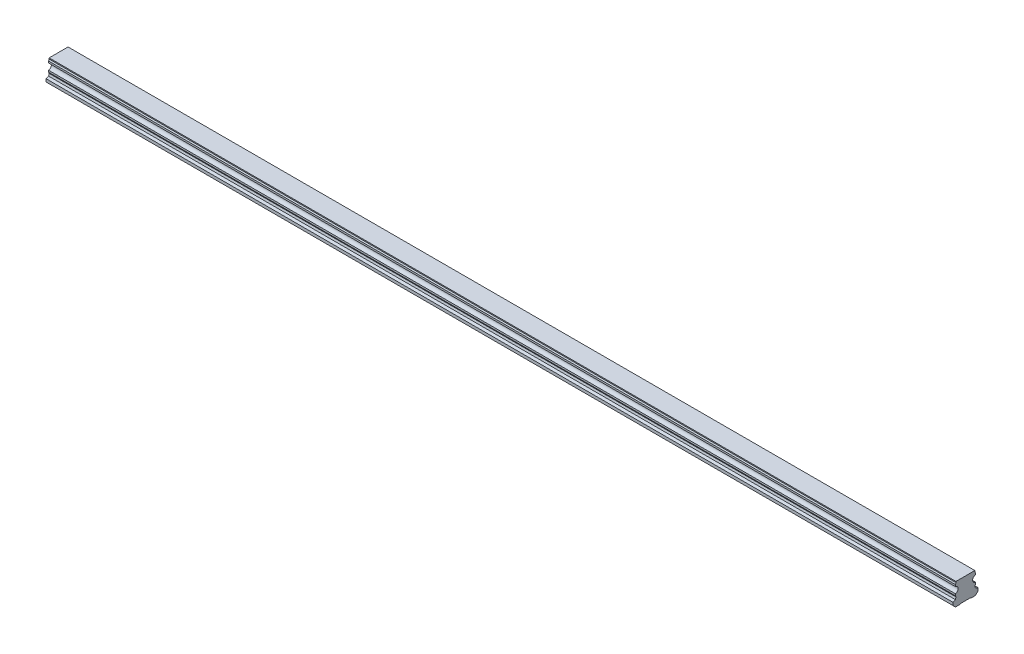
from build123d import *

# Parameters (mm, degrees)
BOSS_EXTRUDE1_DEPTH        = 900
SKETCH3_R                  = 3
SKETCH3_R_2                = 2.5
CUT_EXTRUDE3_DEPTH         = 12
SKETCH3_2_R                = 2.5
CUT_EXTRUDE4_DEPTH         = 15
CHAMFER1_SIZE              = 0.5
LPATTERN4_COUNT            = 15
LPATTERN4_PITCH            = 60
CHAMFER1_OF_LPATTERN4_SIZE = 0.5


with BuildPart() as part:
    # Sketch1 → Boss-Extrude1 (new body)
    with BuildSketch(Plane(origin=(0, 0, 0), x_dir=(0, 0, -1), z_dir=(1, 0, 0))):
        with BuildLine():
            Line((9.375, 21.8), (-9.375, 21.8))
            Line((-9.375, 21.8), (-9.375, 20.756))
            Line((-9.375, 20.756), (-10, 19.415683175))
            Line((-10, 19.415683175), (-10, 17.685449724))
            ThreePointArc((-10, 17.685449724), (-7.2, 14.6), (-10, 11.514550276))
            Line((-10, 11.514550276), (-10, 9.784316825))
            Line((-10, 9.784316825), (-9.375, 8.444))
            Line((-9.375, 8.444), (-9.922688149, 6.4))
            Line((-9.922688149, 6.4), (-12.5, 5.489338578))
            Line((-12.5, 5.489338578), (-12.5, 2.65))
            Line((-12.5, 2.65), (-9.85, 0))
            Line((-9.85, 0), (-5.5, 0))
            Line((-5.5, 0), (-5, 0.5))
            Line((-5, 0.5), (5, 0.5))
            Line((5, 0.5), (5.5, 0))
            Line((5.5, 0), (9.85, 0))
            Line((9.85, 0), (12.5, 2.65))
            Line((12.5, 2.65), (12.5, 5.489338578))
            Line((12.5, 5.489338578), (9.922688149, 6.4))
            Line((9.922688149, 6.4), (9.375, 8.444))
            Line((9.375, 8.444), (10, 9.784316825))
            Line((10, 9.784316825), (10, 11.514550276))
            ThreePointArc((10, 11.514550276), (7.2, 14.6), (10, 17.685449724))
            Line((10, 17.685449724), (10, 19.415683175))
            Line((10, 19.415683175), (9.375, 20.756))
            Line((9.375, 20.756), (9.375, 21.8))
        make_face()
    extrude(amount=BOSS_EXTRUDE1_DEPTH)

    # Sketch3 → Cut-Extrude3 (cut)
    with BuildSketch(Plane.XZ):
        with Locations(Location((30, 0, 0), (0, 0, 270))):
            Circle(SKETCH3_R)
        with Locations(Location((30, 0, 0), (0, 0, 270))):
            Circle(SKETCH3_R_2, mode=Mode.SUBTRACT)
    cut_extrude3 = extrude(amount=-CUT_EXTRUDE3_DEPTH, mode=Mode.SUBTRACT)

    # Sketch3_2 → Cut-Extrude4 (cut)
    with BuildSketch(Plane.XZ):
        with Locations(Location((30, 0, 0), (0, 0, 270))):
            Circle(SKETCH3_2_R)
    cut_extrude4 = extrude(amount=-CUT_EXTRUDE4_DEPTH, mode=Mode.SUBTRACT)

    # Cut-Extrude5 cone 1 section (on through the dimple's axis) → Cut-Extrude5 (revolve, cut)
    with BuildSketch(Plane(origin=(30, 15, 0), x_dir=(0, 0, -1), z_dir=(1, 0, 0))):
        Polygon((0, 0), (2.5, 0), (0, 1.443375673), align=None)
    cut_extrude5 = revolve(axis=Axis((30, 15, 0), (0, 1, 0)), mode=Mode.SUBTRACT)

    # Chamfer1
    chamfer1_edges = [part.edges().sort_by_distance(p)[0] for p in [
        (30, 0.5, 3),
    ]]
    chamfer(chamfer1_edges, length=CHAMFER1_SIZE)

    # LPattern4: Cut-Extrude3, Cut-Extrude4, Cut-Extrude5 ×15
    with Locations(*[(i * LPATTERN4_PITCH, 0, 0) for i in range(1, LPATTERN4_COUNT)]):
        add(cut_extrude3, mode=Mode.SUBTRACT)
        add(cut_extrude4, mode=Mode.SUBTRACT)
        add(cut_extrude5, mode=Mode.SUBTRACT)

    # Chamfer1 of LPattern4
    chamfer1_of_lpattern4_edges = [part.edges().sort_by_distance(p)[0] for p in [
        (90, 0.5, 3),
        (150, 0.5, 3),
        (210, 0.5, 3),
        (270, 0.5, 3),
        (330, 0.5, 3),
        (390, 0.5, 3),
        (450, 0.5, 3),
        (510, 0.5, 3),
        (570, 0.5, 3),
        (630, 0.5, 3),
        (690, 0.5, 3),
        (750, 0.5, 3),
        (810, 0.5, 3),
        (870, 0.5, 3),
    ]]
    chamfer(chamfer1_of_lpattern4_edges, length=CHAMFER1_OF_LPATTERN4_SIZE)


solid = part.part
